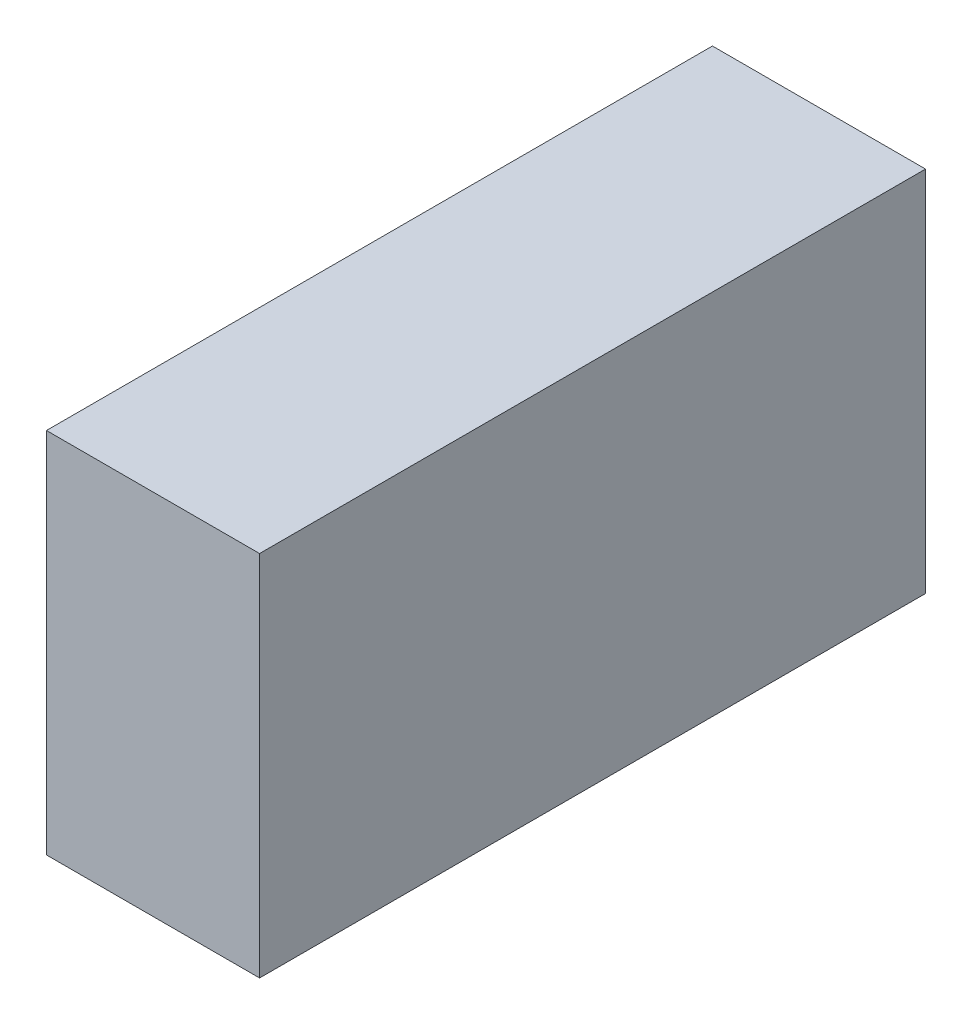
from build123d import *

# Parameters (mm, degrees)
ESQUISSE1_W      = 8
ESQUISSE1_H      = 13.8
EXTRUSION1_DEPTH = 25


with BuildPart() as part:
    # Esquisse1 → Extrusion1 (new body)
    with BuildSketch(Plane.XY):
        with Locations((4, 6.9)):
            Rectangle(ESQUISSE1_W, ESQUISSE1_H)
    extrude(amount=EXTRUSION1_DEPTH)


solid = part.part
